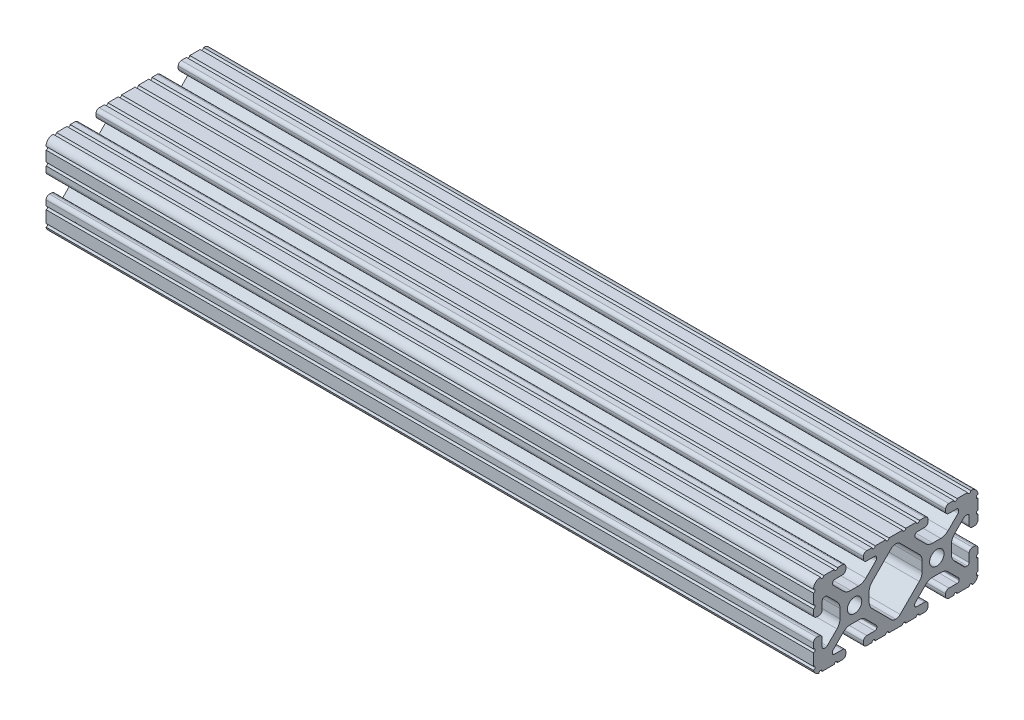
from build123d import *

# Parameters (mm, degrees)
SKETCH1_R      = 3.3274
EXTRUDE1_DEPTH = 355.6
SKETCH2_R      = 3.571875
EXTRUDE2_DEPTH = 38.1


with BuildPart() as part:
    # Sketch1 → Extrude1 (new body)
    with BuildSketch(Plane(origin=(0, 0, 0), x_dir=(0, 0, -1), z_dir=(1, 0, 0))):
        with BuildLine():
            Line((37.1900335, 54.320138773), (37.1900335, 54.882716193))
            ThreePointArc((37.1900335, 54.882716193), (37.450415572, 55.511334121), (38.0790335, 55.771716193))
            Line((38.0790335, 55.771716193), (41.685477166, 55.771716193))
            ThreePointArc((41.685477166, 55.771716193), (42.799028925, 56.232964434), (43.260277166, 57.346516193))
            Line((43.260277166, 57.346516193), (43.260277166, 58.282488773))
            ThreePointArc((43.260277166, 58.282488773), (42.805347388, 59.380786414), (41.707049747, 59.835716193))
            Line((41.707049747, 59.835716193), (39.271813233, 59.835716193))
            ThreePointArc((39.271813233, 59.835716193), (38.509813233, 59.073716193), (37.747813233, 59.835716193))
            Line((37.747813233, 59.835716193), (32.919398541, 59.835716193))
            ThreePointArc((32.919398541, 59.835716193), (32.157398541, 59.073716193), (31.395398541, 59.835716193))
            Line((31.395398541, 59.835716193), (25.153155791, 59.835716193))
            ThreePointArc((25.153155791, 59.835716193), (24.391155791, 59.073716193), (23.629155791, 59.835716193))
            Line((23.629155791, 59.835716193), (18.800741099, 59.835716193))
            ThreePointArc((18.800741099, 59.835716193), (18.038741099, 59.073716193), (17.276741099, 59.835716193))
            Line((17.276741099, 59.835716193), (14.841504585, 59.835716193))
            ThreePointArc((14.841504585, 59.835716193), (13.743206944, 59.380786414), (13.288277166, 58.282488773))
            Line((13.288277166, 58.282488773), (13.288277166, 57.346516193))
            ThreePointArc((13.288277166, 57.346516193), (13.749525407, 56.232964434), (14.863077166, 55.771716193))
            Line((14.863077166, 55.771716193), (18.469520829, 55.771716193))
            ThreePointArc((18.469520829, 55.771716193), (19.098138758, 55.511334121), (19.358520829, 54.882716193))
            Line((19.358520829, 54.882716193), (19.358520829, 54.320138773))
            ThreePointArc((19.358520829, 54.320138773), (19.290850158, 53.979934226), (19.098140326, 53.691522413))
            Line((19.098140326, 53.691522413), (14.421778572, 49.015137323))
            ThreePointArc((14.421778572, 49.015137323), (12.880829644, 47.985503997), (11.063154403, 47.623944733))
            Line((11.063154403, 47.623944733), (7.38539993, 47.623944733))
            ThreePointArc((7.38539993, 47.623944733), (5.567724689, 47.985503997), (4.026775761, 49.015137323))
            Line((4.026775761, 49.015137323), (-0.649585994, 53.691522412))
            ThreePointArc((-0.649585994, 53.691522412), (-0.842295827, 53.979934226), (-0.909966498, 54.320138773))
            Line((-0.909966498, 54.320138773), (-0.909966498, 54.882716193))
            ThreePointArc((-0.909966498, 54.882716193), (-0.649584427, 55.511334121), (-0.020966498, 55.771716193))
            Line((-0.020966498, 55.771716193), (3.585477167, 55.771716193))
            ThreePointArc((3.585477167, 55.771716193), (4.699028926, 56.232964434), (5.160277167, 57.346516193))
            Line((5.160277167, 57.346516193), (5.160277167, 58.266281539))
            ThreePointArc((5.160277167, 58.266281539), (4.744040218, 59.332924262), (3.715361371, 59.835716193))
            Line((3.715361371, 59.835716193), (1.328459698, 59.835716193))
            ThreePointArc((1.328459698, 59.835716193), (0.566459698, 59.073716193), (-0.195540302, 59.835716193))
            Line((-0.195540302, 59.835716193), (-5.021979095, 59.835716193))
            ThreePointArc((-5.021979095, 59.835716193), (-5.807035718, 59.097492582), (-6.545259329, 59.882549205))
            ThreePointArc((-6.545259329, 59.882549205), (-8.87374186, 58.977730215), (-9.863337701, 56.683993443))
            ThreePointArc((-9.863337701, 56.683993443), (-9.063955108, 55.941735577), (-9.825722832, 55.160922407))
            Line((-9.825722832, 55.160922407), (-9.825722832, 50.335417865))
            ThreePointArc((-9.825722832, 50.335417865), (-9.063722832, 49.573417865), (-9.825722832, 48.811417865))
            Line((-9.825722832, 48.811417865), (-9.825722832, 46.424516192))
            ThreePointArc((-9.825722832, 46.424516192), (-9.364474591, 45.310964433), (-8.250922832, 44.849716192))
            Line((-8.250922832, 44.849716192), (-7.336522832, 44.849716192))
            ThreePointArc((-7.336522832, 44.849716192), (-6.222971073, 45.310964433), (-5.761722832, 46.424516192))
            Line((-5.761722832, 46.424516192), (-5.761722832, 50.183716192))
            ThreePointArc((-5.761722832, 50.183716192), (-5.50134076, 50.81233412), (-4.872722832, 51.072716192))
            Line((-4.872722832, 51.072716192), (-4.146379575, 51.072716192))
            ThreePointArc((-4.146379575, 51.072716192), (-3.806172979, 51.005044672), (-3.517760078, 50.812332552))
            Line((-3.517760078, 50.812332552), (1.076701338, 46.217848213))
            ThreePointArc((1.076701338, 46.217848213), (2.10632244, 44.676905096), (2.467877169, 42.859240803))
            Line((2.467877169, 42.859240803), (2.467877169, 38.712191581))
            ThreePointArc((2.467877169, 38.712191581), (2.10632244, 36.894527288), (1.076701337, 35.353584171))
            Line((1.076701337, 35.353584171), (-3.517760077, 30.759099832))
            ThreePointArc((-3.517760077, 30.759099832), (-3.806172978, 30.566387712), (-4.146379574, 30.498716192))
            Line((-4.146379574, 30.498716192), (-4.872722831, 30.498716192))
            ThreePointArc((-4.872722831, 30.498716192), (-5.501340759, 30.759098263), (-5.761722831, 31.387716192))
            Line((-5.761722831, 31.387716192), (-5.761722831, 35.146916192))
            ThreePointArc((-5.761722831, 35.146916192), (-6.222971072, 36.260467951), (-7.336522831, 36.721716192))
            Line((-7.336522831, 36.721716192), (-8.250922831, 36.721716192))
            ThreePointArc((-8.250922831, 36.721716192), (-9.36447459, 36.260467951), (-9.825722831, 35.146916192))
            Line((-9.825722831, 35.146916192), (-9.825722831, 32.760014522))
            ThreePointArc((-9.825722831, 32.760014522), (-9.063722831, 31.998014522), (-9.825722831, 31.236014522))
            Line((-9.825722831, 31.236014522), (-9.825722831, 25.74969698))
            ThreePointArc((-9.825722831, 25.74969698), (-9.063722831, 24.98769698), (-9.825722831, 24.22569698))
            ThreePointArc((-9.825722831, 24.22569698), (-8.934545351, 22.601713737), (-7.296996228, 21.735716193))
            ThreePointArc((-7.296996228, 21.735716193), (-6.534996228, 22.497716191), (-5.77299623, 21.735716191))
            Line((-5.77299623, 21.735716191), (-0.195540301, 21.735716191))
            ThreePointArc((-0.195540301, 21.735716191), (0.566459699, 22.497716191), (1.328459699, 21.735716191))
            Line((1.328459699, 21.735716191), (3.585477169, 21.735716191))
            ThreePointArc((3.585477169, 21.735716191), (4.699028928, 22.196964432), (5.160277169, 23.310516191))
            Line((5.160277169, 23.310516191), (5.160277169, 24.224916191))
            ThreePointArc((5.160277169, 24.224916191), (4.699028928, 25.33846795), (3.585477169, 25.799716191))
            Line((3.585477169, 25.799716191), (-0.173722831, 25.799716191))
            ThreePointArc((-0.173722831, 25.799716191), (-0.80234076, 26.060098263), (-1.062722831, 26.688716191))
            Line((-1.062722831, 26.688716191), (-1.062722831, 27.098536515))
            ThreePointArc((-1.062722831, 27.098536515), (-0.99505216, 27.438741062), (-0.802342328, 27.727152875))
            Line((-0.802342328, 27.727152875), (4.026775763, 32.556295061))
            ThreePointArc((4.026775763, 32.556295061), (5.567724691, 33.585928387), (7.385399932, 33.947487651))
            Line((7.385399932, 33.947487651), (11.063154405, 33.947487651))
            ThreePointArc((11.063154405, 33.947487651), (12.880829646, 33.585928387), (14.421778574, 32.556295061))
            Line((14.421778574, 32.556295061), (19.250896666, 27.727152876))
            ThreePointArc((19.250896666, 27.727152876), (19.443606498, 27.438741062), (19.511277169, 27.098536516))
            Line((19.511277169, 27.098536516), (19.511277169, 26.688716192))
            ThreePointArc((19.511277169, 26.688716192), (19.250895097, 26.060098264), (18.622277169, 25.799716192))
            Line((18.622277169, 25.799716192), (14.863077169, 25.799716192))
            ThreePointArc((14.863077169, 25.799716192), (13.74952541, 25.338467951), (13.288277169, 24.224916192))
            Line((13.288277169, 24.224916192), (13.288277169, 23.310516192))
            ThreePointArc((13.288277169, 23.310516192), (13.74952541, 22.196964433), (14.863077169, 21.735716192))
            Line((14.863077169, 21.735716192), (17.276741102, 21.735716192))
            ThreePointArc((17.276741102, 21.735716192), (18.038741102, 22.497716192), (18.800741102, 21.735716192))
            Line((18.800741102, 21.735716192), (23.629155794, 21.735716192))
            ThreePointArc((23.629155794, 21.735716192), (24.391155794, 22.497716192), (25.153155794, 21.735716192))
            Line((25.153155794, 21.735716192), (31.395398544, 21.735716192))
            ThreePointArc((31.395398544, 21.735716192), (32.157398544, 22.497716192), (32.919398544, 21.735716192))
            Line((32.919398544, 21.735716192), (37.747813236, 21.735716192))
            ThreePointArc((37.747813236, 21.735716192), (38.509813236, 22.497716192), (39.271813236, 21.735716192))
            Line((39.271813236, 21.735716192), (41.685477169, 21.735716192))
            ThreePointArc((41.685477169, 21.735716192), (42.799028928, 22.196964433), (43.260277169, 23.310516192))
            Line((43.260277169, 23.310516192), (43.260277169, 24.224916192))
            ThreePointArc((43.260277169, 24.224916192), (42.799028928, 25.338467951), (41.685477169, 25.799716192))
            Line((41.685477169, 25.799716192), (37.926277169, 25.799716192))
            ThreePointArc((37.926277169, 25.799716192), (37.29765924, 26.060098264), (37.037277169, 26.688716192))
            Line((37.037277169, 26.688716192), (37.037277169, 27.098536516))
            ThreePointArc((37.037277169, 27.098536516), (37.10494784, 27.438741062), (37.297657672, 27.727152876))
            Line((37.297657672, 27.727152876), (42.126775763, 32.556295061))
            ThreePointArc((42.126775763, 32.556295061), (43.667724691, 33.585928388), (45.485399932, 33.947487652))
            Line((45.485399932, 33.947487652), (49.163154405, 33.947487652))
            ThreePointArc((49.163154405, 33.947487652), (50.980829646, 33.585928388), (52.521778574, 32.556295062))
            Line((52.521778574, 32.556295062), (57.350896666, 27.727152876))
            ThreePointArc((57.350896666, 27.727152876), (57.543606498, 27.438741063), (57.611277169, 27.098536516))
            Line((57.611277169, 27.098536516), (57.611277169, 26.688716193))
            ThreePointArc((57.611277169, 26.688716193), (57.350895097, 26.060098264), (56.722277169, 25.799716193))
            Line((56.722277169, 25.799716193), (52.963077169, 25.799716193))
            ThreePointArc((52.963077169, 25.799716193), (51.84952541, 25.338467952), (51.388277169, 24.224916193))
            Line((51.388277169, 24.224916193), (51.388277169, 23.310516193))
            ThreePointArc((51.388277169, 23.310516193), (51.84952541, 22.196964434), (52.963077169, 21.735716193))
            Line((52.963077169, 21.735716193), (55.220094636, 21.735716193))
            ThreePointArc((55.220094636, 21.735716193), (55.982094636, 22.497716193), (56.744094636, 21.735716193))
            Line((56.744094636, 21.735716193), (62.321550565, 21.735716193))
            ThreePointArc((62.321550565, 21.735716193), (63.083550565, 22.497716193), (63.845550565, 21.735716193))
            ThreePointArc((63.845550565, 21.735716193), (65.481854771, 22.602978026), (66.374277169, 24.225696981))
            ThreePointArc((66.374277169, 24.225696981), (65.612277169, 24.987696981), (66.374277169, 25.749696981))
            Line((66.374277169, 25.749696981), (66.374277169, 31.236014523))
            ThreePointArc((66.374277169, 31.236014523), (65.612277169, 31.998014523), (66.374277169, 32.760014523))
            Line((66.374277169, 32.760014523), (66.374277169, 35.146916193))
            ThreePointArc((66.374277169, 35.146916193), (65.913028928, 36.260467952), (64.799477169, 36.721716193))
            Line((64.799477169, 36.721716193), (63.885077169, 36.721716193))
            ThreePointArc((63.885077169, 36.721716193), (62.77152541, 36.260467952), (62.310277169, 35.146916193))
            Line((62.310277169, 35.146916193), (62.310277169, 31.387716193))
            ThreePointArc((62.310277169, 31.387716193), (62.049895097, 30.759098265), (61.421277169, 30.498716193))
            Line((61.421277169, 30.498716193), (60.694933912, 30.498716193))
            ThreePointArc((60.694933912, 30.498716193), (60.354727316, 30.566387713), (60.066314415, 30.759099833))
            Line((60.066314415, 30.759099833), (55.471853, 35.353584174))
            ThreePointArc((55.471853, 35.353584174), (54.442231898, 36.894527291), (54.08067717, 38.712191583))
            Line((54.08067717, 38.712191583), (54.08067717, 42.859240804))
            ThreePointArc((54.08067717, 42.859240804), (54.442231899, 44.676905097), (55.471853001, 46.217848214))
            Line((55.471853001, 46.217848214), (60.066314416, 50.812332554))
            ThreePointArc((60.066314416, 50.812332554), (60.354727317, 51.005044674), (60.694933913, 51.072716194))
            Line((60.694933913, 51.072716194), (61.42127717, 51.072716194))
            ThreePointArc((61.42127717, 51.072716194), (62.049895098, 50.812334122), (62.31027717, 50.183716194))
            Line((62.31027717, 50.183716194), (62.31027717, 46.424516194))
            ThreePointArc((62.31027717, 46.424516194), (62.771525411, 45.310964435), (63.88507717, 44.849716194))
            Line((63.88507717, 44.849716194), (64.79947717, 44.849716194))
            ThreePointArc((64.79947717, 44.849716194), (65.913028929, 45.310964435), (66.37427717, 46.424516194))
            Line((66.37427717, 46.424516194), (66.37427717, 48.811417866))
            ThreePointArc((66.37427717, 48.811417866), (65.61227717, 49.573417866), (66.37427717, 50.335417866))
            Line((66.37427717, 50.335417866), (66.37427717, 55.160922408))
            ThreePointArc((66.37427717, 55.160922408), (65.612509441, 55.941735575), (66.411892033, 56.683993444))
            ThreePointArc((66.411892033, 56.683993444), (65.422296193, 58.977730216), (63.093813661, 59.882549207))
            ThreePointArc((63.093813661, 59.882549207), (62.355590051, 59.097492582), (61.570533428, 59.835716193))
            Line((61.570533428, 59.835716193), (56.744094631, 59.835716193))
            ThreePointArc((56.744094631, 59.835716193), (55.982094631, 59.073716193), (55.220094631, 59.835716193))
            Line((55.220094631, 59.835716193), (52.833192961, 59.835716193))
            ThreePointArc((52.833192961, 59.835716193), (51.804514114, 59.332924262), (51.388277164, 58.266281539))
            Line((51.388277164, 58.266281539), (51.388277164, 57.346516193))
            ThreePointArc((51.388277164, 57.346516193), (51.849525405, 56.232964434), (52.963077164, 55.771716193))
            Line((52.963077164, 55.771716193), (56.569520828, 55.771716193))
            ThreePointArc((56.569520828, 55.771716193), (57.198138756, 55.511334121), (57.458520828, 54.882716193))
            Line((57.458520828, 54.882716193), (57.458520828, 54.320138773))
            ThreePointArc((57.458520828, 54.320138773), (57.390850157, 53.979934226), (57.198140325, 53.691522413))
            Line((57.198140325, 53.691522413), (52.52177857, 49.015137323))
            ThreePointArc((52.52177857, 49.015137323), (50.980829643, 47.985503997), (49.163154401, 47.623944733))
            Line((49.163154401, 47.623944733), (45.485399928, 47.623944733))
            ThreePointArc((45.485399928, 47.623944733), (43.667724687, 47.985503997), (42.12677576, 49.015137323))
            Line((42.12677576, 49.015137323), (37.450414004, 53.691522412))
            ThreePointArc((37.450414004, 53.691522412), (37.257704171, 53.979934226), (37.1900335, 54.320138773))
        make_face()
        with Locations((47.324277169, 40.785716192)):
            Circle(SKETCH1_R, mode=Mode.SUBTRACT)
        with Locations((9.224277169, 40.785716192)):
            Circle(SKETCH1_R, mode=Mode.SUBTRACT)
        with BuildLine():
            Line((30.35131253, 26.52815133), (39.176701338, 35.353584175))
            ThreePointArc((39.176701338, 35.353584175), (40.206322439, 36.894527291), (40.567877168, 38.712191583))
            Line((40.567877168, 38.712191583), (40.567877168, 42.859240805))
            ThreePointArc((40.567877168, 42.859240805), (40.206322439, 44.676905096), (39.176701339, 46.217848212))
            Line((39.176701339, 46.217848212), (30.35131253, 55.043281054))
            ThreePointArc((30.35131253, 55.043281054), (29.39832277, 55.678689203), (28.274277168, 55.898812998))
            ThreePointArc((28.274277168, 55.898812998), (27.150231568, 55.678689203), (26.197241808, 55.043281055))
            Line((26.197241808, 55.043281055), (17.371853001, 46.217848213))
            ThreePointArc((17.371853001, 46.217848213), (16.342231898, 44.676905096), (15.980677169, 42.859240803))
            Line((15.980677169, 42.859240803), (15.980677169, 38.712191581))
            ThreePointArc((15.980677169, 38.712191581), (16.342231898, 36.894527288), (17.371853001, 35.353584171))
            Line((17.371853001, 35.353584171), (26.197241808, 26.528151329))
            ThreePointArc((26.197241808, 26.528151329), (27.150231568, 25.892743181), (28.274277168, 25.672619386))
            ThreePointArc((28.274277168, 25.672619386), (29.39832277, 25.892743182), (30.35131253, 26.52815133))
        make_face(mode=Mode.SUBTRACT)
    extrude(amount=EXTRUDE1_DEPTH)

    # Sketch2 → Extrude2 (cut)
    with BuildSketch(Plane.XZ.offset(-21.735716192)):
        with Locations(Location((19.05, -9.224277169, 0), (0, 0, 210.985509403))):
            Circle(SKETCH2_R)
        with Locations(Location((19.05, -47.324277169, 0), (0, 0, 210.985509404))):
            Circle(SKETCH2_R)
    extrude(amount=-EXTRUDE2_DEPTH, mode=Mode.SUBTRACT)


solid = part.part
